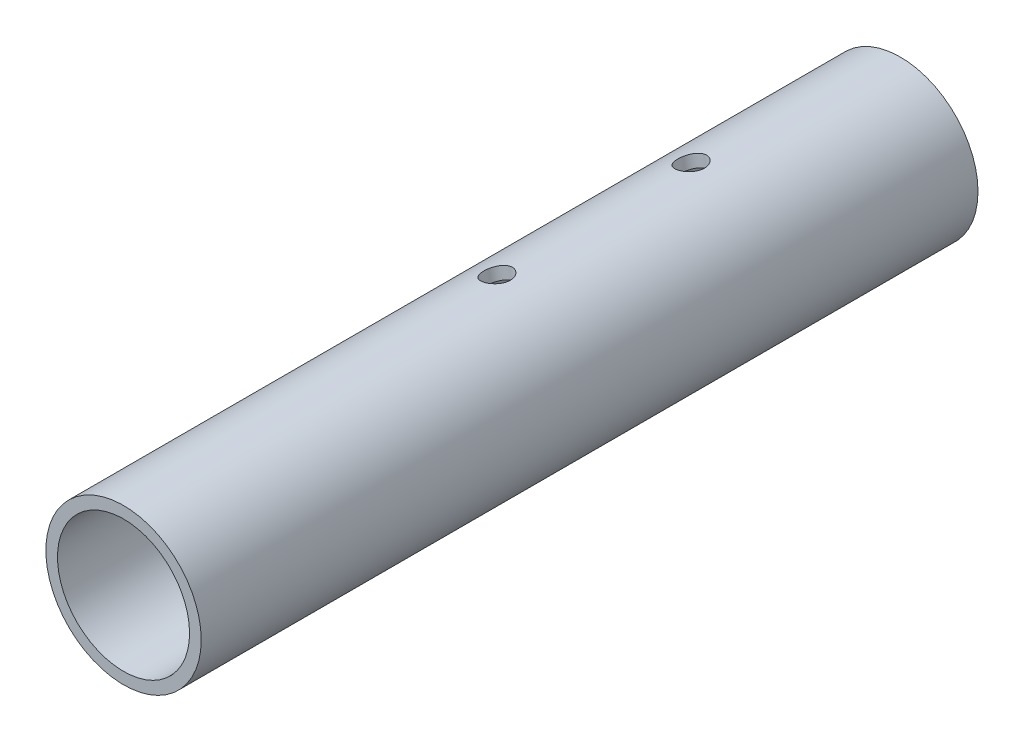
ISO-10303-21;
HEADER;
FILE_DESCRIPTION(('STEP AP214'),'2;1');
FILE_NAME('part.step','',(''),(''),'','','');
FILE_SCHEMA(('AUTOMOTIVE_DESIGN { 1 0 10303 214 1 1 1 1 }'));
ENDSEC;
DATA;
#1=APPLICATION_CONTEXT('core data for automotive mechanical design processes');
#2=APPLICATION_PROTOCOL_DEFINITION('international standard','automotive_design',2000,#1);
#3=PRODUCT_CONTEXT('',#1,'mechanical');
#4=PRODUCT('Part','Part','',(#3));
#5=PRODUCT_RELATED_PRODUCT_CATEGORY('part','',(#4));
#6=PRODUCT_DEFINITION_FORMATION('','',#4);
#7=PRODUCT_DEFINITION_CONTEXT('part definition',#1,'design');
#8=PRODUCT_DEFINITION('design','',#6,#7);
#9=PRODUCT_DEFINITION_SHAPE('','',#8);
#10=(LENGTH_UNIT() NAMED_UNIT(*) SI_UNIT(.MILLI.,.METRE.));
#11=(NAMED_UNIT(*) PLANE_ANGLE_UNIT() SI_UNIT($,.RADIAN.));
#12=(NAMED_UNIT(*) SI_UNIT($,.STERADIAN.) SOLID_ANGLE_UNIT());
#13=UNCERTAINTY_MEASURE_WITH_UNIT(LENGTH_MEASURE(1.E-05),#10,'distance_accuracy_value','');
#14=(GEOMETRIC_REPRESENTATION_CONTEXT(3) GLOBAL_UNCERTAINTY_ASSIGNED_CONTEXT((#13)) GLOBAL_UNIT_ASSIGNED_CONTEXT((#10,
#11,#12)) REPRESENTATION_CONTEXT('',''));
#15=CARTESIAN_POINT('',(0.,0.,0.));
#16=DIRECTION('',(0.,0.,1.));
#17=DIRECTION('',(1.,0.,0.));
#18=AXIS2_PLACEMENT_3D('',#15,#16,#17);
#19=CARTESIAN_POINT('',(-10.4241869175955,-1.53847980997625,200.));
#20=DIRECTION('',(0.,0.,1.));
#21=DIRECTION('',(1.,0.,0.));
#22=AXIS2_PLACEMENT_3D('',#19,#20,#21);
#23=PLANE('',#22);
#24=CARTESIAN_POINT('',(-10.4241869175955,-1.53847980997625,200.));
#25=DIRECTION('',(0.,0.,1.));
#26=DIRECTION('',(1.,0.,0.));
#27=AXIS2_PLACEMENT_3D('',#24,#25,#26);
#28=CIRCLE('',#27,20.);
#29=CARTESIAN_POINT('',(9.5758130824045,-1.53847980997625,200.));
#30=VERTEX_POINT('',#29);
#31=EDGE_CURVE('E10',#30,#30,#28,.T.);
#32=ORIENTED_EDGE('',*,*,#31,.T.);
#33=EDGE_LOOP('',(#32));
#34=FACE_BOUND('',#33,.T.);
#35=CARTESIAN_POINT('',(-10.4241869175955,-1.53847980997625,200.));
#36=DIRECTION('',(0.,0.,1.));
#37=DIRECTION('',(1.,0.,0.));
#38=AXIS2_PLACEMENT_3D('',#35,#36,#37);
#39=CIRCLE('',#38,17.);
#40=CARTESIAN_POINT('',(6.5758130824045,-1.53847980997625,200.));
#41=VERTEX_POINT('',#40);
#42=EDGE_CURVE('E46',#41,#41,#39,.T.);
#43=ORIENTED_EDGE('',*,*,#42,.F.);
#44=EDGE_LOOP('',(#43));
#45=FACE_BOUND('',#44,.T.);
#46=ADVANCED_FACE('F28',(#34,#45),#23,.T.);
#47=CARTESIAN_POINT('',(-10.4241869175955,-1.53847980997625,0.));
#48=DIRECTION('',(0.,0.,1.));
#49=DIRECTION('',(1.,0.,0.));
#50=AXIS2_PLACEMENT_3D('',#47,#48,#49);
#51=PLANE('',#50);
#52=CARTESIAN_POINT('',(-10.4241869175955,-1.53847980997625,0.));
#53=DIRECTION('',(0.,0.,1.));
#54=DIRECTION('',(1.,0.,0.));
#55=AXIS2_PLACEMENT_3D('',#52,#53,#54);
#56=CIRCLE('',#55,20.);
#57=CARTESIAN_POINT('',(9.5758130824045,-1.53847980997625,0.));
#58=VERTEX_POINT('',#57);
#59=EDGE_CURVE('E41',#58,#58,#56,.T.);
#60=ORIENTED_EDGE('',*,*,#59,.F.);
#61=EDGE_LOOP('',(#60));
#62=FACE_BOUND('',#61,.T.);
#63=CARTESIAN_POINT('',(-10.4241869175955,-1.53847980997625,0.));
#64=DIRECTION('',(0.,0.,1.));
#65=DIRECTION('',(1.,0.,0.));
#66=AXIS2_PLACEMENT_3D('',#63,#64,#65);
#67=CIRCLE('',#66,17.);
#68=CARTESIAN_POINT('',(6.5758130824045,-1.53847980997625,0.));
#69=VERTEX_POINT('',#68);
#70=EDGE_CURVE('E49',#69,#69,#67,.T.);
#71=ORIENTED_EDGE('',*,*,#70,.T.);
#72=EDGE_LOOP('',(#71));
#73=FACE_BOUND('',#72,.T.);
#74=ADVANCED_FACE('F96',(#62,#73),#51,.F.);
#75=CARTESIAN_POINT('',(-10.4241869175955,-1.53847980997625,200.));
#76=DIRECTION('',(0.,0.,-1.));
#77=DIRECTION('',(-1.,0.,0.));
#78=AXIS2_PLACEMENT_3D('',#75,#76,#77);
#79=CYLINDRICAL_SURFACE('',#78,20.);
#80=CARTESIAN_POINT('',(-10.8369903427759,18.4572595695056,50.));
#81=CARTESIAN_POINT('',(-10.8369986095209,18.4572616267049,50.1949746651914));
#82=CARTESIAN_POINT('',(-10.853594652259,18.4569380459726,50.3900521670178));
#83=CARTESIAN_POINT('',(-10.9194575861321,18.4554130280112,50.7747231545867));
#84=CARTESIAN_POINT('',(-10.9687536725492,18.4542108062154,50.9643115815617));
#85=CARTESIAN_POINT('',(-11.0983300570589,18.4502595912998,51.3323821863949));
#86=CARTESIAN_POINT('',(-11.1785833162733,18.4475119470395,51.5108738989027));
#87=CARTESIAN_POINT('',(-11.3675143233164,18.4394838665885,51.8520123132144));
#88=CARTESIAN_POINT('',(-11.476189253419,18.4342036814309,52.0146605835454));
#89=CARTESIAN_POINT('',(-11.7198743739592,18.4198816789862,52.3212773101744));
#90=CARTESIAN_POINT('',(-11.855130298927,18.4108037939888,52.4650488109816));
#91=CARTESIAN_POINT('',(-12.1473021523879,18.3876916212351,52.7281180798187));
#92=CARTESIAN_POINT('',(-12.304219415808,18.3736570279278,52.8474143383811));
#93=CARTESIAN_POINT('',(-12.6362664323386,18.3395155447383,53.0588920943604));
#94=CARTESIAN_POINT('',(-12.8115096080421,18.3193691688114,53.1508893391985));
#95=CARTESIAN_POINT('',(-13.1741811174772,18.2723991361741,53.3039722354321));
#96=CARTESIAN_POINT('',(-13.3616085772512,18.2455759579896,53.365060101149));
#97=CARTESIAN_POINT('',(-13.7411432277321,18.1854732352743,53.4539851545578));
#98=CARTESIAN_POINT('',(-13.9331835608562,18.1522620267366,53.4821537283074));
#99=CARTESIAN_POINT('',(-14.3181140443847,18.0797686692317,53.5054718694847));
#100=CARTESIAN_POINT('',(-14.5110041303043,18.0404869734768,53.5006239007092));
#101=CARTESIAN_POINT('',(-14.8899563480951,17.9575232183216,53.4583033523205));
#102=CARTESIAN_POINT('',(-15.0760700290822,17.9138938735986,53.4211874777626));
#103=CARTESIAN_POINT('',(-15.4385398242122,17.8236268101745,53.3159473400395));
#104=CARTESIAN_POINT('',(-15.6148956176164,17.7769889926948,53.2478220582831));
#105=CARTESIAN_POINT('',(-15.9540389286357,17.6826519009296,53.0821481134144));
#106=CARTESIAN_POINT('',(-16.1167542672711,17.6349484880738,52.984454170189));
#107=CARTESIAN_POINT('',(-16.4234918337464,17.5411979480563,52.7625227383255));
#108=CARTESIAN_POINT('',(-16.5675123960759,17.4951509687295,52.6382828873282));
#109=CARTESIAN_POINT('',(-16.8350639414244,17.4067256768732,52.3648127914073));
#110=CARTESIAN_POINT('',(-16.9582952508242,17.3644046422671,52.215270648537));
#111=CARTESIAN_POINT('',(-17.1787507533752,17.2867577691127,51.896487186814));
#112=CARTESIAN_POINT('',(-17.2759746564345,17.2514320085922,51.7272456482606));
#113=CARTESIAN_POINT('',(-17.4419835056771,17.190065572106,51.3734942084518));
#114=CARTESIAN_POINT('',(-17.5107304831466,17.1640372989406,51.1889643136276));
#115=CARTESIAN_POINT('',(-17.6177050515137,17.1231548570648,50.8100840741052));
#116=CARTESIAN_POINT('',(-17.6559356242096,17.1082995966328,50.615734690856));
#117=CARTESIAN_POINT('',(-17.700501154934,17.0909545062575,50.2254703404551));
#118=CARTESIAN_POINT('',(-17.707249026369,17.0883046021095,50.0296095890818));
#119=CARTESIAN_POINT('',(-17.6897817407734,17.0951246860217,49.6394936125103));
#120=CARTESIAN_POINT('',(-17.665567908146,17.1045941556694,49.4452383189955));
#121=CARTESIAN_POINT('',(-17.5871414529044,17.1348651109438,49.0652517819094));
#122=CARTESIAN_POINT('',(-17.5331418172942,17.1555861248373,48.8794700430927));
#123=CARTESIAN_POINT('',(-17.3967415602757,17.2068865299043,48.5200960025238));
#124=CARTESIAN_POINT('',(-17.3143390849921,17.2374665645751,48.346504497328));
#125=CARTESIAN_POINT('',(-17.122277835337,17.3068397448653,48.0145046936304));
#126=CARTESIAN_POINT('',(-17.0123515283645,17.3457129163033,47.856267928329));
#127=CARTESIAN_POINT('',(-16.7684457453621,17.4290437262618,47.561248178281));
#128=CARTESIAN_POINT('',(-16.6344643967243,17.473501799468,47.4244668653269));
#129=CARTESIAN_POINT('',(-16.3441107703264,17.5659158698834,47.1746336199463));
#130=CARTESIAN_POINT('',(-16.1874980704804,17.6139062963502,47.0618735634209));
#131=CARTESIAN_POINT('',(-15.8571251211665,17.7102278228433,46.86533406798));
#132=CARTESIAN_POINT('',(-15.6833654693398,17.7585589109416,46.7815536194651));
#133=CARTESIAN_POINT('',(-15.3242255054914,17.8528557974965,46.6457991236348));
#134=CARTESIAN_POINT('',(-15.1389042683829,17.898831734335,46.5936759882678));
#135=CARTESIAN_POINT('',(-14.7610914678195,17.9866025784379,46.5222371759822));
#136=CARTESIAN_POINT('',(-14.5686005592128,18.0283978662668,46.5029185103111));
#137=CARTESIAN_POINT('',(-14.1846109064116,18.1057831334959,46.4977300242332));
#138=CARTESIAN_POINT('',(-13.9931331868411,18.141448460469,46.5114173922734));
#139=CARTESIAN_POINT('',(-13.6141319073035,18.2064240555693,46.5708900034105));
#140=CARTESIAN_POINT('',(-13.4266083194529,18.235734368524,46.616675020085));
#141=CARTESIAN_POINT('',(-13.0611577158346,18.2877764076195,46.7388667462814));
#142=CARTESIAN_POINT('',(-12.8832181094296,18.3105169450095,46.8152321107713));
#143=CARTESIAN_POINT('',(-12.541700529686,18.3498514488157,46.99636612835));
#144=CARTESIAN_POINT('',(-12.3781233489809,18.3664450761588,47.1011363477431));
#145=CARTESIAN_POINT('',(-12.0679983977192,18.3944694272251,47.3376583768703));
#146=CARTESIAN_POINT('',(-11.9216905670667,18.405832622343,47.4697328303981));
#147=CARTESIAN_POINT('',(-11.6527567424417,18.4242061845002,47.7564396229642));
#148=CARTESIAN_POINT('',(-11.5301363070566,18.4312155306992,47.9110772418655));
#149=CARTESIAN_POINT('',(-11.3114386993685,18.4421333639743,48.239975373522));
#150=CARTESIAN_POINT('',(-11.2155787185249,18.4460169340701,48.4143811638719));
#151=CARTESIAN_POINT('',(-11.0548469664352,18.4517375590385,48.7768337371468));
#152=CARTESIAN_POINT('',(-10.9899448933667,18.4535766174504,48.9648669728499));
#153=CARTESIAN_POINT('',(-10.9069099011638,18.4557227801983,49.2946389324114));
#154=CARTESIAN_POINT('',(-10.8807368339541,18.456316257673,49.434405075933));
#155=CARTESIAN_POINT('',(-10.8457742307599,18.457083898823,49.716096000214));
#156=CARTESIAN_POINT('',(-10.8369843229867,18.4572580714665,49.8580207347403));
#157=CARTESIAN_POINT('',(-10.8369903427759,18.4572595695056,50.));
#158=B_SPLINE_CURVE_WITH_KNOTS('',3,(#80,#81,#82,#83,#84,#85,#86,#87,#88,#89,#90,#91,#92,#93,
#94,#95,#96,#97,#98,#99,#100,#101,#102,#103,#104,#105,#106,#107,#108,#109,#110,#111,#112,#113,
#114,#115,#116,#117,#118,#119,#120,#121,#122,#123,#124,#125,#126,#127,#128,#129,#130,#131,#132,
#133,#134,#135,#136,#137,#138,#139,#140,#141,#142,#143,#144,#145,#146,#147,#148,#149,#150,#151,
#152,#153,#154,#155,#156,#157),.UNSPECIFIED.,.T.,.F.,(4,2,2,2,2,2,2,2,2,2,2,2,2,2,2,2,2,2,2,2,2,
2,2,2,2,2,2,2,2,2,2,2,2,2,2,2,2,2,4),(0.,0.584404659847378,1.16933179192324,1.75374918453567,
2.33810865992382,2.92814866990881,3.51822505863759,4.11219797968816,4.70612834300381,
5.29402687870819,5.88188154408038,6.46331923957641,7.04477603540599,7.6291374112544,
8.21355081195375,8.80577741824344,9.39801063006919,9.99103095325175,10.5839933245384,
11.1691563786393,11.7542944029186,12.3353015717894,12.9163466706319,13.5032750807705,
14.0902492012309,14.683993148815,15.2777164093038,15.8686214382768,16.4594726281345,
17.0424411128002,17.6254054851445,18.2075843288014,18.7897952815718,19.3793255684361,
19.9689940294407,20.5633177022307,21.1570584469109,21.5826271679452,22.0081867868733),.UNSPECIFIED.);
#159=CARTESIAN_POINT('',(-10.8369903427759,18.4572595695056,50.));
#160=VERTEX_POINT('',#159);
#161=EDGE_CURVE('E59',#160,#160,#158,.T.);
#162=ORIENTED_EDGE('',*,*,#161,.T.);
#163=EDGE_LOOP('',(#162));
#164=FACE_BOUND('',#163,.T.);
#165=CARTESIAN_POINT('',(-3.14615687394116,-20.1672285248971,50.));
#166=CARTESIAN_POINT('',(-3.14616372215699,-20.1672335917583,49.8050253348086));
#167=CARTESIAN_POINT('',(-3.16161789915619,-20.1732917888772,49.6099478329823));
#168=CARTESIAN_POINT('',(-3.22304149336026,-20.1971118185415,49.2252768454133));
#169=CARTESIAN_POINT('',(-3.26903817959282,-20.2148841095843,49.0356884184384));
#170=CARTESIAN_POINT('',(-3.3902450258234,-20.2608683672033,48.6676178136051));
#171=CARTESIAN_POINT('',(-3.46542969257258,-20.2890712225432,48.4891261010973));
#172=CARTESIAN_POINT('',(-3.643025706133,-20.3540252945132,48.1479876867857));
#173=CARTESIAN_POINT('',(-3.74543435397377,-20.3907756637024,47.9853394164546));
#174=CARTESIAN_POINT('',(-3.97601915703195,-20.4708893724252,47.6787226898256));
#175=CARTESIAN_POINT('',(-4.10443611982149,-20.5143135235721,47.5349511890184));
#176=CARTESIAN_POINT('',(-4.38317654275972,-20.6048803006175,47.2718819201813));
#177=CARTESIAN_POINT('',(-4.53350135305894,-20.6520231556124,47.1525856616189));
#178=CARTESIAN_POINT('',(-4.85330034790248,-20.7476759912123,46.9411079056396));
#179=CARTESIAN_POINT('',(-5.02289442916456,-20.7961929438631,46.8491106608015));
#180=CARTESIAN_POINT('',(-5.37589608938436,-20.8917263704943,46.6960277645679));
#181=CARTESIAN_POINT('',(-5.55930267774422,-20.938742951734,46.634939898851));
#182=CARTESIAN_POINT('',(-5.93291175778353,-21.028604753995,46.5460148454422));
#183=CARTESIAN_POINT('',(-6.12302631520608,-21.0714874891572,46.5178462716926));
#184=CARTESIAN_POINT('',(-6.50636589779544,-21.1519705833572,46.4945281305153));
#185=CARTESIAN_POINT('',(-6.69959068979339,-21.1895713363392,46.4993760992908));
#186=CARTESIAN_POINT('',(-7.08141865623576,-21.2580926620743,46.5416966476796));
#187=CARTESIAN_POINT('',(-7.27004925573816,-21.2890816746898,46.5788125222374));
#188=CARTESIAN_POINT('',(-7.63944947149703,-21.3445431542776,46.6840526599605));
#189=CARTESIAN_POINT('',(-7.82021882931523,-21.3690154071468,46.7521779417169));
#190=CARTESIAN_POINT('',(-8.16963073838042,-21.4117821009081,46.9178518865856));
#191=CARTESIAN_POINT('',(-8.33820820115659,-21.4300450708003,47.015545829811));
#192=CARTESIAN_POINT('',(-8.65746133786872,-21.4609405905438,47.2374772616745));
#193=CARTESIAN_POINT('',(-8.80813541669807,-21.4735726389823,47.3617171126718));
#194=CARTESIAN_POINT('',(-9.08915149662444,-21.4943770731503,47.6351872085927));
#195=CARTESIAN_POINT('',(-9.21919474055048,-21.5024875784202,47.784729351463));
#196=CARTESIAN_POINT('',(-9.4525782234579,-21.5152082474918,48.103512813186));
#197=CARTESIAN_POINT('',(-9.55591816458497,-21.5198183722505,48.2727543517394));
#198=CARTESIAN_POINT('',(-9.73277154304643,-21.5267220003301,48.6265057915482));
#199=CARTESIAN_POINT('',(-9.80624515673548,-21.5290124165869,48.8110356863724));
#200=CARTESIAN_POINT('',(-9.92072054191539,-21.5322246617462,49.1899159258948));
#201=CARTESIAN_POINT('',(-9.96172548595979,-21.5331466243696,49.384265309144));
#202=CARTESIAN_POINT('',(-10.0095359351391,-21.5341952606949,49.7745296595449));
#203=CARTESIAN_POINT('',(-10.0167841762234,-21.5343322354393,49.9703904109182));
#204=CARTESIAN_POINT('',(-9.99803672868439,-21.533941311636,50.3605063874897));
#205=CARTESIAN_POINT('',(-9.97204246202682,-21.5334134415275,50.5547616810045));
#206=CARTESIAN_POINT('',(-9.88800248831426,-21.5313343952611,50.9347482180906));
#207=CARTESIAN_POINT('',(-9.83018434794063,-21.5297904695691,51.1205299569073));
#208=CARTESIAN_POINT('',(-9.6845370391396,-21.5249301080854,51.4799039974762));
#209=CARTESIAN_POINT('',(-9.59670591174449,-21.5216135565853,51.653495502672));
#210=CARTESIAN_POINT('',(-9.39272022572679,-21.5121266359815,51.9854953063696));
#211=CARTESIAN_POINT('',(-9.27628788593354,-21.5059277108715,52.143732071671));
#212=CARTESIAN_POINT('',(-9.01906549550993,-21.4894748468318,52.438751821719));
#213=CARTESIAN_POINT('',(-8.87827354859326,-21.4792205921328,52.5755331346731));
#214=CARTESIAN_POINT('',(-8.57466664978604,-21.453366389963,52.8253663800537));
#215=CARTESIAN_POINT('',(-8.41161642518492,-21.4377061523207,52.9381264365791));
#216=CARTESIAN_POINT('',(-8.06954580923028,-21.4001320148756,53.13466593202));
#217=CARTESIAN_POINT('',(-7.89052597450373,-21.3782183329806,53.2184463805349));
#218=CARTESIAN_POINT('',(-7.52265799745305,-21.3277548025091,53.3542008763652));
#219=CARTESIAN_POINT('',(-7.33386054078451,-21.299236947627,53.4063240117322));
#220=CARTESIAN_POINT('',(-6.95124373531,-21.2355925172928,53.4777628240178));
#221=CARTESIAN_POINT('',(-6.75742484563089,-21.2004665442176,53.497081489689));
#222=CARTESIAN_POINT('',(-6.37308049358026,-21.1248626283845,53.5022699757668));
#223=CARTESIAN_POINT('',(-6.18254559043,-21.0844623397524,53.4885826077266));
#224=CARTESIAN_POINT('',(-5.80756265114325,-20.9993060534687,53.4291099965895));
#225=CARTESIAN_POINT('',(-5.62311457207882,-20.9545500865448,53.383324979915));
#226=CARTESIAN_POINT('',(-5.26560295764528,-20.8626372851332,53.2611332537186));
#227=CARTESIAN_POINT('',(-5.09252441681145,-20.8154837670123,53.1847678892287));
#228=CARTESIAN_POINT('',(-4.76198801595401,-20.7210001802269,53.00363387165));
#229=CARTESIAN_POINT('',(-4.60453101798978,-20.6736701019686,52.8988636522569));
#230=CARTESIAN_POINT('',(-4.30732521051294,-20.5807639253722,52.6623416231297));
#231=CARTESIAN_POINT('',(-4.16782390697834,-20.5352173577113,52.5302671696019));
#232=CARTESIAN_POINT('',(-3.91236422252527,-20.4491746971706,52.2435603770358));
#233=CARTESIAN_POINT('',(-3.79641136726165,-20.4086797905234,52.0889227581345));
#234=CARTESIAN_POINT('',(-3.59021219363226,-20.3349929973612,51.760024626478));
#235=CARTESIAN_POINT('',(-3.50017604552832,-20.3018612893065,51.5856188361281));
#236=CARTESIAN_POINT('',(-3.34951234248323,-20.2455774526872,51.2231662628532));
#237=CARTESIAN_POINT('',(-3.28885602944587,-20.222415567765,51.0351330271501));
#238=CARTESIAN_POINT('',(-3.21133219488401,-20.1925915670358,50.7053610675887));
#239=CARTESIAN_POINT('',(-3.18692806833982,-20.1831142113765,50.565594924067));
#240=CARTESIAN_POINT('',(-3.15433808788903,-20.1704309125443,50.283903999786));
#241=CARTESIAN_POINT('',(-3.14615188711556,-20.1672248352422,50.1419792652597));
#242=CARTESIAN_POINT('',(-3.14615687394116,-20.1672285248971,50.));
#243=B_SPLINE_CURVE_WITH_KNOTS('',3,(#165,#166,#167,#168,#169,#170,#171,#172,#173,#174,#175,
#176,#177,#178,#179,#180,#181,#182,#183,#184,#185,#186,#187,#188,#189,#190,#191,#192,#193,#194,
#195,#196,#197,#198,#199,#200,#201,#202,#203,#204,#205,#206,#207,#208,#209,#210,#211,#212,#213,
#214,#215,#216,#217,#218,#219,#220,#221,#222,#223,#224,#225,#226,#227,#228,#229,#230,#231,#232,
#233,#234,#235,#236,#237,#238,#239,#240,#241,#242),.UNSPECIFIED.,.T.,.F.,(4,2,2,2,2,2,2,2,2,2,2,
2,2,2,2,2,2,2,2,2,2,2,2,2,2,2,2,2,2,2,2,2,2,2,2,2,2,2,4),(0.,0.584404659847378,1.16933179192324,
1.75374918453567,2.33810865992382,2.92814866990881,3.51822505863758,4.11219797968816,
4.7061283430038,5.29402687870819,5.88188154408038,6.46331923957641,7.04477603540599,
7.62913741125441,8.21355081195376,8.80577741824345,9.3980106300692,9.99103095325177,
10.5839933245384,11.1691563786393,11.7542944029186,12.3353015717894,12.9163466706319,
13.5032750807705,14.0902492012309,14.683993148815,15.2777164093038,15.8686214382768,
16.4594726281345,17.0424411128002,17.6254054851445,18.2075843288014,18.7897952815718,
19.3793255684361,19.9689940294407,20.5633177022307,21.1570584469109,21.5826271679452,
22.0081867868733),.UNSPECIFIED.);
#244=CARTESIAN_POINT('',(-3.14615687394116,-20.1672285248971,50.));
#245=VERTEX_POINT('',#244);
#246=EDGE_CURVE('E162',#245,#245,#243,.T.);
#247=ORIENTED_EDGE('',*,*,#246,.T.);
#248=EDGE_LOOP('',(#247));
#249=FACE_BOUND('',#248,.T.);
#250=CARTESIAN_POINT('',(-10.8369903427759,18.4572595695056,100.));
#251=CARTESIAN_POINT('',(-10.8369986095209,18.4572616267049,100.194974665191));
#252=CARTESIAN_POINT('',(-10.853594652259,18.4569380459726,100.390052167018));
#253=CARTESIAN_POINT('',(-10.9194575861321,18.4554130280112,100.774723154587));
#254=CARTESIAN_POINT('',(-10.9687536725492,18.4542108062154,100.964311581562));
#255=CARTESIAN_POINT('',(-11.0983300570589,18.4502595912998,101.332382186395));
#256=CARTESIAN_POINT('',(-11.1785833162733,18.4475119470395,101.510873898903));
#257=CARTESIAN_POINT('',(-11.3675143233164,18.4394838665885,101.852012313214));
#258=CARTESIAN_POINT('',(-11.476189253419,18.4342036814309,102.014660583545));
#259=CARTESIAN_POINT('',(-11.7198743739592,18.4198816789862,102.321277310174));
#260=CARTESIAN_POINT('',(-11.855130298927,18.4108037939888,102.465048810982));
#261=CARTESIAN_POINT('',(-12.1473021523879,18.3876916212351,102.728118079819));
#262=CARTESIAN_POINT('',(-12.304219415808,18.3736570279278,102.847414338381));
#263=CARTESIAN_POINT('',(-12.6362664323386,18.3395155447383,103.05889209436));
#264=CARTESIAN_POINT('',(-12.8115096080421,18.3193691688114,103.150889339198));
#265=CARTESIAN_POINT('',(-13.1741811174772,18.2723991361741,103.303972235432));
#266=CARTESIAN_POINT('',(-13.3616085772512,18.2455759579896,103.365060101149));
#267=CARTESIAN_POINT('',(-13.7411432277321,18.1854732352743,103.453985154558));
#268=CARTESIAN_POINT('',(-13.9331835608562,18.1522620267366,103.482153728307));
#269=CARTESIAN_POINT('',(-14.3181140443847,18.0797686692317,103.505471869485));
#270=CARTESIAN_POINT('',(-14.5110041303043,18.0404869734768,103.500623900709));
#271=CARTESIAN_POINT('',(-14.8899563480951,17.9575232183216,103.45830335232));
#272=CARTESIAN_POINT('',(-15.0760700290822,17.9138938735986,103.421187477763));
#273=CARTESIAN_POINT('',(-15.4385398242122,17.8236268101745,103.31594734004));
#274=CARTESIAN_POINT('',(-15.6148956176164,17.7769889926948,103.247822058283));
#275=CARTESIAN_POINT('',(-15.9540389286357,17.6826519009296,103.082148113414));
#276=CARTESIAN_POINT('',(-16.1167542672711,17.6349484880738,102.984454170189));
#277=CARTESIAN_POINT('',(-16.4234918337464,17.5411979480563,102.762522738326));
#278=CARTESIAN_POINT('',(-16.5675123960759,17.4951509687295,102.638282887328));
#279=CARTESIAN_POINT('',(-16.8350639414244,17.4067256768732,102.364812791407));
#280=CARTESIAN_POINT('',(-16.9582952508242,17.3644046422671,102.215270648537));
#281=CARTESIAN_POINT('',(-17.1787507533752,17.2867577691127,101.896487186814));
#282=CARTESIAN_POINT('',(-17.2759746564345,17.2514320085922,101.727245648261));
#283=CARTESIAN_POINT('',(-17.4419835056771,17.190065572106,101.373494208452));
#284=CARTESIAN_POINT('',(-17.5107304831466,17.1640372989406,101.188964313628));
#285=CARTESIAN_POINT('',(-17.6177050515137,17.1231548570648,100.810084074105));
#286=CARTESIAN_POINT('',(-17.6559356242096,17.1082995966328,100.615734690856));
#287=CARTESIAN_POINT('',(-17.700501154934,17.0909545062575,100.225470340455));
#288=CARTESIAN_POINT('',(-17.707249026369,17.0883046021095,100.029609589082));
#289=CARTESIAN_POINT('',(-17.6897817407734,17.0951246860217,99.6394936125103));
#290=CARTESIAN_POINT('',(-17.665567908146,17.1045941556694,99.4452383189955));
#291=CARTESIAN_POINT('',(-17.5871414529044,17.1348651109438,99.0652517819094));
#292=CARTESIAN_POINT('',(-17.5331418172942,17.1555861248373,98.8794700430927));
#293=CARTESIAN_POINT('',(-17.3967415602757,17.2068865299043,98.5200960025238));
#294=CARTESIAN_POINT('',(-17.3143390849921,17.2374665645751,98.346504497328));
#295=CARTESIAN_POINT('',(-17.122277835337,17.3068397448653,98.0145046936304));
#296=CARTESIAN_POINT('',(-17.0123515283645,17.3457129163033,97.856267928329));
#297=CARTESIAN_POINT('',(-16.7684457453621,17.4290437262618,97.561248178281));
#298=CARTESIAN_POINT('',(-16.6344643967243,17.473501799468,97.4244668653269));
#299=CARTESIAN_POINT('',(-16.3441107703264,17.5659158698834,97.1746336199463));
#300=CARTESIAN_POINT('',(-16.1874980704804,17.6139062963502,97.0618735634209));
#301=CARTESIAN_POINT('',(-15.8571251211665,17.7102278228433,96.86533406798));
#302=CARTESIAN_POINT('',(-15.6833654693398,17.7585589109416,96.7815536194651));
#303=CARTESIAN_POINT('',(-15.3242255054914,17.8528557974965,96.6457991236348));
#304=CARTESIAN_POINT('',(-15.1389042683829,17.898831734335,96.5936759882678));
#305=CARTESIAN_POINT('',(-14.7610914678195,17.9866025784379,96.5222371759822));
#306=CARTESIAN_POINT('',(-14.5686005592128,18.0283978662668,96.502918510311));
#307=CARTESIAN_POINT('',(-14.1846109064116,18.1057831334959,96.4977300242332));
#308=CARTESIAN_POINT('',(-13.9931331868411,18.141448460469,96.5114173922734));
#309=CARTESIAN_POINT('',(-13.6141319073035,18.2064240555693,96.5708900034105));
#310=CARTESIAN_POINT('',(-13.4266083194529,18.235734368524,96.616675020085));
#311=CARTESIAN_POINT('',(-13.0611577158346,18.2877764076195,96.7388667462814));
#312=CARTESIAN_POINT('',(-12.8832181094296,18.3105169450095,96.8152321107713));
#313=CARTESIAN_POINT('',(-12.541700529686,18.3498514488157,96.99636612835));
#314=CARTESIAN_POINT('',(-12.3781233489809,18.3664450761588,97.1011363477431));
#315=CARTESIAN_POINT('',(-12.0679983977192,18.3944694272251,97.3376583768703));
#316=CARTESIAN_POINT('',(-11.9216905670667,18.405832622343,97.4697328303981));
#317=CARTESIAN_POINT('',(-11.6527567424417,18.4242061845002,97.7564396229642));
#318=CARTESIAN_POINT('',(-11.5301363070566,18.4312155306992,97.9110772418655));
#319=CARTESIAN_POINT('',(-11.3114386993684,18.4421333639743,98.239975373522));
#320=CARTESIAN_POINT('',(-11.2155787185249,18.4460169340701,98.4143811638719));
#321=CARTESIAN_POINT('',(-11.0548469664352,18.4517375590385,98.7768337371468));
#322=CARTESIAN_POINT('',(-10.9899448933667,18.4535766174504,98.9648669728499));
#323=CARTESIAN_POINT('',(-10.9069099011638,18.4557227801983,99.2946389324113));
#324=CARTESIAN_POINT('',(-10.8807368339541,18.456316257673,99.434405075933));
#325=CARTESIAN_POINT('',(-10.8457742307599,18.457083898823,99.716096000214));
#326=CARTESIAN_POINT('',(-10.8369843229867,18.4572580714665,99.8580207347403));
#327=CARTESIAN_POINT('',(-10.8369903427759,18.4572595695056,100.));
#328=B_SPLINE_CURVE_WITH_KNOTS('',3,(#250,#251,#252,#253,#254,#255,#256,#257,#258,#259,#260,
#261,#262,#263,#264,#265,#266,#267,#268,#269,#270,#271,#272,#273,#274,#275,#276,#277,#278,#279,
#280,#281,#282,#283,#284,#285,#286,#287,#288,#289,#290,#291,#292,#293,#294,#295,#296,#297,#298,
#299,#300,#301,#302,#303,#304,#305,#306,#307,#308,#309,#310,#311,#312,#313,#314,#315,#316,#317,
#318,#319,#320,#321,#322,#323,#324,#325,#326,#327),.UNSPECIFIED.,.T.,.F.,(4,2,2,2,2,2,2,2,2,2,2,
2,2,2,2,2,2,2,2,2,2,2,2,2,2,2,2,2,2,2,2,2,2,2,2,2,2,2,4),(0.,0.584404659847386,1.16933179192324,
1.75374918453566,2.3381086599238,2.9281486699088,3.51822505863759,4.11219797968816,
4.7061283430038,5.29402687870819,5.88188154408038,6.46331923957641,7.04477603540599,
7.62913741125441,8.21355081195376,8.80577741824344,9.39801063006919,9.99103095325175,
10.5839933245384,11.1691563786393,11.7542944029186,12.3353015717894,12.9163466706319,
13.5032750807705,14.0902492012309,14.683993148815,15.2777164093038,15.8686214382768,
16.4594726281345,17.0424411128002,17.6254054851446,18.2075843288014,18.7897952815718,
19.3793255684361,19.9689940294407,20.5633177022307,21.1570584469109,21.5826271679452,
22.0081867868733),.UNSPECIFIED.);
#329=CARTESIAN_POINT('',(-10.8369903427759,18.4572595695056,100.));
#330=VERTEX_POINT('',#329);
#331=EDGE_CURVE('E83',#330,#330,#328,.T.);
#332=ORIENTED_EDGE('',*,*,#331,.T.);
#333=EDGE_LOOP('',(#332));
#334=FACE_BOUND('',#333,.T.);
#335=CARTESIAN_POINT('',(-3.14615687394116,-20.1672285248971,100.));
#336=CARTESIAN_POINT('',(-3.14616372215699,-20.1672335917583,99.8050253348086));
#337=CARTESIAN_POINT('',(-3.16161789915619,-20.1732917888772,99.6099478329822));
#338=CARTESIAN_POINT('',(-3.22304149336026,-20.1971118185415,99.2252768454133));
#339=CARTESIAN_POINT('',(-3.26903817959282,-20.2148841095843,99.0356884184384));
#340=CARTESIAN_POINT('',(-3.3902450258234,-20.2608683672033,98.6676178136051));
#341=CARTESIAN_POINT('',(-3.46542969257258,-20.2890712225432,98.4891261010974));
#342=CARTESIAN_POINT('',(-3.64302570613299,-20.3540252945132,98.1479876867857));
#343=CARTESIAN_POINT('',(-3.74543435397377,-20.3907756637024,97.9853394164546));
#344=CARTESIAN_POINT('',(-3.97601915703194,-20.4708893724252,97.6787226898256));
#345=CARTESIAN_POINT('',(-4.10443611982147,-20.5143135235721,97.5349511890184));
#346=CARTESIAN_POINT('',(-4.38317654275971,-20.6048803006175,97.2718819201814));
#347=CARTESIAN_POINT('',(-4.53350135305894,-20.6520231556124,97.1525856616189));
#348=CARTESIAN_POINT('',(-4.85330034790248,-20.7476759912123,96.9411079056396));
#349=CARTESIAN_POINT('',(-5.02289442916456,-20.7961929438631,96.8491106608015));
#350=CARTESIAN_POINT('',(-5.37589608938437,-20.8917263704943,96.6960277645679));
#351=CARTESIAN_POINT('',(-5.55930267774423,-20.938742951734,96.634939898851));
#352=CARTESIAN_POINT('',(-5.93291175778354,-21.028604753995,96.5460148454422));
#353=CARTESIAN_POINT('',(-6.12302631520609,-21.0714874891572,96.5178462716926));
#354=CARTESIAN_POINT('',(-6.50636589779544,-21.1519705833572,96.4945281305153));
#355=CARTESIAN_POINT('',(-6.69959068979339,-21.1895713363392,96.4993760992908));
#356=CARTESIAN_POINT('',(-7.08141865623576,-21.2580926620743,96.5416966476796));
#357=CARTESIAN_POINT('',(-7.27004925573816,-21.2890816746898,96.5788125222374));
#358=CARTESIAN_POINT('',(-7.63944947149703,-21.3445431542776,96.6840526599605));
#359=CARTESIAN_POINT('',(-7.82021882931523,-21.3690154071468,96.7521779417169));
#360=CARTESIAN_POINT('',(-8.16963073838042,-21.4117821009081,96.9178518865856));
#361=CARTESIAN_POINT('',(-8.33820820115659,-21.4300450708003,97.015545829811));
#362=CARTESIAN_POINT('',(-8.65746133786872,-21.4609405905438,97.2374772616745));
#363=CARTESIAN_POINT('',(-8.80813541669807,-21.4735726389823,97.3617171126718));
#364=CARTESIAN_POINT('',(-9.08915149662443,-21.4943770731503,97.6351872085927));
#365=CARTESIAN_POINT('',(-9.21919474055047,-21.5024875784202,97.784729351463));
#366=CARTESIAN_POINT('',(-9.45257822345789,-21.5152082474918,98.103512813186));
#367=CARTESIAN_POINT('',(-9.55591816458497,-21.5198183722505,98.2727543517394));
#368=CARTESIAN_POINT('',(-9.73277154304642,-21.5267220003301,98.6265057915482));
#369=CARTESIAN_POINT('',(-9.80624515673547,-21.5290124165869,98.8110356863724));
#370=CARTESIAN_POINT('',(-9.92072054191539,-21.5322246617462,99.1899159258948));
#371=CARTESIAN_POINT('',(-9.96172548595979,-21.5331466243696,99.384265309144));
#372=CARTESIAN_POINT('',(-10.0095359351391,-21.5341952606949,99.7745296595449));
#373=CARTESIAN_POINT('',(-10.0167841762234,-21.5343322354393,99.9703904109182));
#374=CARTESIAN_POINT('',(-9.99803672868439,-21.533941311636,100.36050638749));
#375=CARTESIAN_POINT('',(-9.97204246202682,-21.5334134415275,100.554761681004));
#376=CARTESIAN_POINT('',(-9.88800248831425,-21.5313343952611,100.934748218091));
#377=CARTESIAN_POINT('',(-9.83018434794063,-21.5297904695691,101.120529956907));
#378=CARTESIAN_POINT('',(-9.68453703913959,-21.5249301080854,101.479903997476));
#379=CARTESIAN_POINT('',(-9.59670591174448,-21.5216135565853,101.653495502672));
#380=CARTESIAN_POINT('',(-9.39272022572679,-21.5121266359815,101.98549530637));
#381=CARTESIAN_POINT('',(-9.27628788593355,-21.5059277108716,102.143732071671));
#382=CARTESIAN_POINT('',(-9.01906549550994,-21.4894748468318,102.438751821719));
#383=CARTESIAN_POINT('',(-8.87827354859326,-21.4792205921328,102.575533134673));
#384=CARTESIAN_POINT('',(-8.57466664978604,-21.453366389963,102.825366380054));
#385=CARTESIAN_POINT('',(-8.41161642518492,-21.4377061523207,102.938126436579));
#386=CARTESIAN_POINT('',(-8.06954580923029,-21.4001320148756,103.13466593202));
#387=CARTESIAN_POINT('',(-7.89052597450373,-21.3782183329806,103.218446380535));
#388=CARTESIAN_POINT('',(-7.52265799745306,-21.3277548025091,103.354200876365));
#389=CARTESIAN_POINT('',(-7.33386054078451,-21.299236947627,103.406324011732));
#390=CARTESIAN_POINT('',(-6.95124373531,-21.2355925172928,103.477762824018));
#391=CARTESIAN_POINT('',(-6.75742484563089,-21.2004665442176,103.497081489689));
#392=CARTESIAN_POINT('',(-6.37308049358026,-21.1248626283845,103.502269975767));
#393=CARTESIAN_POINT('',(-6.18254559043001,-21.0844623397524,103.488582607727));
#394=CARTESIAN_POINT('',(-5.80756265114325,-20.9993060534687,103.42910999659));
#395=CARTESIAN_POINT('',(-5.62311457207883,-20.9545500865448,103.383324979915));
#396=CARTESIAN_POINT('',(-5.26560295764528,-20.8626372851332,103.261133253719));
#397=CARTESIAN_POINT('',(-5.09252441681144,-20.8154837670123,103.184767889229));
#398=CARTESIAN_POINT('',(-4.76198801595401,-20.7210001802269,103.00363387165));
#399=CARTESIAN_POINT('',(-4.60453101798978,-20.6736701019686,102.898863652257));
#400=CARTESIAN_POINT('',(-4.30732521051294,-20.5807639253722,102.66234162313));
#401=CARTESIAN_POINT('',(-4.16782390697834,-20.5352173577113,102.530267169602));
#402=CARTESIAN_POINT('',(-3.91236422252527,-20.4491746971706,102.243560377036));
#403=CARTESIAN_POINT('',(-3.79641136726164,-20.4086797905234,102.088922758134));
#404=CARTESIAN_POINT('',(-3.59021219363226,-20.3349929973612,101.760024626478));
#405=CARTESIAN_POINT('',(-3.50017604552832,-20.3018612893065,101.585618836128));
#406=CARTESIAN_POINT('',(-3.34951234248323,-20.2455774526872,101.223166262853));
#407=CARTESIAN_POINT('',(-3.28885602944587,-20.222415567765,101.03513302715));
#408=CARTESIAN_POINT('',(-3.21133219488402,-20.1925915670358,100.705361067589));
#409=CARTESIAN_POINT('',(-3.18692806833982,-20.1831142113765,100.565594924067));
#410=CARTESIAN_POINT('',(-3.15433808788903,-20.1704309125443,100.283903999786));
#411=CARTESIAN_POINT('',(-3.14615188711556,-20.1672248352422,100.14197926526));
#412=CARTESIAN_POINT('',(-3.14615687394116,-20.1672285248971,100.));
#413=B_SPLINE_CURVE_WITH_KNOTS('',3,(#335,#336,#337,#338,#339,#340,#341,#342,#343,#344,#345,
#346,#347,#348,#349,#350,#351,#352,#353,#354,#355,#356,#357,#358,#359,#360,#361,#362,#363,#364,
#365,#366,#367,#368,#369,#370,#371,#372,#373,#374,#375,#376,#377,#378,#379,#380,#381,#382,#383,
#384,#385,#386,#387,#388,#389,#390,#391,#392,#393,#394,#395,#396,#397,#398,#399,#400,#401,#402,
#403,#404,#405,#406,#407,#408,#409,#410,#411,#412),.UNSPECIFIED.,.T.,.F.,(4,2,2,2,2,2,2,2,2,2,2,
2,2,2,2,2,2,2,2,2,2,2,2,2,2,2,2,2,2,2,2,2,2,2,2,2,2,2,4),(0.,0.584404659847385,1.16933179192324,
1.75374918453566,2.3381086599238,2.9281486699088,3.51822505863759,4.11219797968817,
4.70612834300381,5.2940268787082,5.88188154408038,6.46331923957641,7.04477603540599,
7.6291374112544,8.21355081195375,8.80577741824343,9.39801063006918,9.99103095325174,
10.5839933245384,11.1691563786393,11.7542944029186,12.3353015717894,12.9163466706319,
13.5032750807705,14.0902492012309,14.683993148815,15.2777164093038,15.8686214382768,
16.4594726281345,17.0424411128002,17.6254054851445,18.2075843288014,18.7897952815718,
19.3793255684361,19.9689940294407,20.5633177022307,21.1570584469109,21.5826271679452,
22.0081867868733),.UNSPECIFIED.);
#414=CARTESIAN_POINT('',(-3.14615687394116,-20.1672285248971,100.));
#415=VERTEX_POINT('',#414);
#416=EDGE_CURVE('E78',#415,#415,#413,.T.);
#417=ORIENTED_EDGE('',*,*,#416,.T.);
#418=EDGE_LOOP('',(#417));
#419=FACE_BOUND('',#418,.T.);
#420=ORIENTED_EDGE('',*,*,#31,.F.);
#421=EDGE_LOOP('',(#420));
#422=FACE_BOUND('',#421,.T.);
#423=ORIENTED_EDGE('',*,*,#59,.T.);
#424=EDGE_LOOP('',(#423));
#425=FACE_BOUND('',#424,.T.);
#426=ADVANCED_FACE('F30',(#164,#249,#334,#419,#422,#425),#79,.T.);
#427=CARTESIAN_POINT('',(-10.4241869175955,-1.53847980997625,200.));
#428=DIRECTION('',(0.,0.,-1.));
#429=DIRECTION('',(-1.,0.,0.));
#430=AXIS2_PLACEMENT_3D('',#427,#428,#429);
#431=CYLINDRICAL_SURFACE('',#430,17.);
#432=CARTESIAN_POINT('',(-10.2402864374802,15.4605254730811,50.));
#433=CARTESIAN_POINT('',(-10.2402941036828,15.4605279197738,50.1943479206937));
#434=CARTESIAN_POINT('',(-10.2568886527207,15.4607300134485,50.3887832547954));
#435=CARTESIAN_POINT('',(-10.3227112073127,15.4612480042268,50.7721446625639));
#436=CARTESIAN_POINT('',(-10.3719645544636,15.4615639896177,50.9610663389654));
#437=CARTESIAN_POINT('',(-10.5013394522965,15.461467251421,51.327798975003));
#438=CARTESIAN_POINT('',(-10.5814293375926,15.4610552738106,51.5056211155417));
#439=CARTESIAN_POINT('',(-10.7698668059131,15.4582653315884,51.8455477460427));
#440=CARTESIAN_POINT('',(-10.8782131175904,15.4558874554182,52.0076529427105));
#441=CARTESIAN_POINT('',(-11.1215107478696,15.4476531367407,52.3139788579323));
#442=CARTESIAN_POINT('',(-11.2568001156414,15.4417503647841,52.4579298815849));
#443=CARTESIAN_POINT('',(-11.5490470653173,15.4248946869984,52.7215044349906));
#444=CARTESIAN_POINT('',(-11.7060062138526,15.4139414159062,52.8411262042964));
#445=CARTESIAN_POINT('',(-12.038611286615,15.3855181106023,53.0536993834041));
#446=CARTESIAN_POINT('',(-12.2144168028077,15.3679886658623,53.146393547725));
#447=CARTESIAN_POINT('',(-12.5783014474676,15.3254847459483,53.3008189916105));
#448=CARTESIAN_POINT('',(-12.7663793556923,15.300511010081,53.3625533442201));
#449=CARTESIAN_POINT('',(-13.1464934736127,15.2432202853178,53.4524645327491));
#450=CARTESIAN_POINT('',(-13.3384379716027,15.2110105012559,53.4810971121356));
#451=CARTESIAN_POINT('',(-13.7230854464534,15.1395151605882,53.5054148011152));
#452=CARTESIAN_POINT('',(-13.9157883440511,15.1002303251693,53.5011032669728));
#453=CARTESIAN_POINT('',(-14.2934360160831,15.0164523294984,53.4599988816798));
#454=CARTESIAN_POINT('',(-14.4784539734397,14.9720466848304,53.4236970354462));
#455=CARTESIAN_POINT('',(-14.8387024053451,14.8793966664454,53.3204224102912));
#456=CARTESIAN_POINT('',(-15.0139324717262,14.831152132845,53.2534483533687));
#457=CARTESIAN_POINT('',(-15.3511762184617,14.7328404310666,53.0902818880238));
#458=CARTESIAN_POINT('',(-15.5130947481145,14.6827633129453,52.9938990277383));
#459=CARTESIAN_POINT('',(-15.8184233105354,14.5838032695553,52.7747921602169));
#460=CARTESIAN_POINT('',(-15.9618310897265,14.5349204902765,52.6520649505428));
#461=CARTESIAN_POINT('',(-16.2291612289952,14.4403431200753,52.3810657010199));
#462=CARTESIAN_POINT('',(-16.3526750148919,14.3947240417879,52.2323639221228));
#463=CARTESIAN_POINT('',(-16.5738937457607,14.3106574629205,51.9150526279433));
#464=CARTESIAN_POINT('',(-16.6715981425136,14.2722101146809,51.7464426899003));
#465=CARTESIAN_POINT('',(-16.8388835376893,14.2050855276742,51.393481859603));
#466=CARTESIAN_POINT('',(-16.9083971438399,14.1764317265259,51.2090945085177));
#467=CARTESIAN_POINT('',(-17.0170390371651,14.1311660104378,50.8301726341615));
#468=CARTESIAN_POINT('',(-17.0561715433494,14.1145524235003,50.6356395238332));
#469=CARTESIAN_POINT('',(-17.1024998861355,14.0948424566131,50.2457230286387));
#470=CARTESIAN_POINT('',(-17.1102613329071,14.0915066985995,50.0504188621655));
#471=CARTESIAN_POINT('',(-17.0951813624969,14.097948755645,49.6612230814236));
#472=CARTESIAN_POINT('',(-17.072341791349,14.1077257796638,49.467331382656));
#473=CARTESIAN_POINT('',(-16.9971104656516,14.1394759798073,49.0885081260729));
#474=CARTESIAN_POINT('',(-16.9450243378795,14.1613229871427,48.903505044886));
#475=CARTESIAN_POINT('',(-16.8129235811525,14.2155390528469,48.5453982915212));
#476=CARTESIAN_POINT('',(-16.7329065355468,14.2479090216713,48.3722956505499));
#477=CARTESIAN_POINT('',(-16.5456797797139,14.321455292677,48.0402804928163));
#478=CARTESIAN_POINT('',(-16.4381110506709,14.3627466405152,47.8815960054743));
#479=CARTESIAN_POINT('',(-16.1989779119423,14.4511418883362,47.5853159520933));
#480=CARTESIAN_POINT('',(-16.0674108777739,14.4982464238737,47.4477226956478));
#481=CARTESIAN_POINT('',(-15.7811028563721,14.5961620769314,47.1952339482));
#482=CARTESIAN_POINT('',(-15.6260182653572,14.6470211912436,47.0807461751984));
#483=CARTESIAN_POINT('',(-15.2982245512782,14.7487287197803,46.8806174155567));
#484=CARTESIAN_POINT('',(-15.1255161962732,14.7995771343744,46.7949751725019));
#485=CARTESIAN_POINT('',(-14.7681201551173,14.8981978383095,46.6555547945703));
#486=CARTESIAN_POINT('',(-14.583510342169,14.9459867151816,46.6015890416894));
#487=CARTESIAN_POINT('',(-14.2065517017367,15.0365392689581,46.5264614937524));
#488=CARTESIAN_POINT('',(-14.0142038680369,15.079303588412,46.5052954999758));
#489=CARTESIAN_POINT('',(-13.6309652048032,15.157451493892,46.4965389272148));
#490=CARTESIAN_POINT('',(-13.44011286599,15.1929565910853,46.5083366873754));
#491=CARTESIAN_POINT('',(-13.0618757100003,15.2567394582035,46.5638168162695));
#492=CARTESIAN_POINT('',(-12.8744908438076,15.285017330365,46.6074987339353));
#493=CARTESIAN_POINT('',(-12.5090555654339,15.3341980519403,46.7252286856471));
#494=CARTESIAN_POINT('',(-12.3309826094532,15.3551194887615,46.799199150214));
#495=CARTESIAN_POINT('',(-11.9886553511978,15.3902556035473,46.9753270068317));
#496=CARTESIAN_POINT('',(-11.8244022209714,15.4044697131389,47.0774867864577));
#497=CARTESIAN_POINT('',(-11.5116352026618,15.4274417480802,47.309135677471));
#498=CARTESIAN_POINT('',(-11.3634366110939,15.4361027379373,47.4390601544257));
#499=CARTESIAN_POINT('',(-11.0903058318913,15.4490163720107,47.7216607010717));
#500=CARTESIAN_POINT('',(-10.9653791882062,15.4532679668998,47.8743421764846));
#501=CARTESIAN_POINT('',(-10.7412902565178,15.4589373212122,48.2002392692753));
#502=CARTESIAN_POINT('',(-10.6424420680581,15.4603217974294,48.3736716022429));
#503=CARTESIAN_POINT('',(-10.4757382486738,15.4616480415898,48.7347350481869));
#504=CARTESIAN_POINT('',(-10.4078550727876,15.4615910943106,48.9223533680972));
#505=CARTESIAN_POINT('',(-10.3180915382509,15.4612316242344,49.2586066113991));
#506=CARTESIAN_POINT('',(-10.2889731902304,15.4609936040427,49.4053508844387));
#507=CARTESIAN_POINT('',(-10.2500680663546,15.4606395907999,49.7013796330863));
#508=CARTESIAN_POINT('',(-10.2402805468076,15.4605235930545,49.8506640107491));
#509=CARTESIAN_POINT('',(-10.2402864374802,15.4605254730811,50.));
#510=B_SPLINE_CURVE_WITH_KNOTS('',3,(#432,#433,#434,#435,#436,#437,#438,#439,#440,#441,#442,
#443,#444,#445,#446,#447,#448,#449,#450,#451,#452,#453,#454,#455,#456,#457,#458,#459,#460,#461,
#462,#463,#464,#465,#466,#467,#468,#469,#470,#471,#472,#473,#474,#475,#476,#477,#478,#479,#480,
#481,#482,#483,#484,#485,#486,#487,#488,#489,#490,#491,#492,#493,#494,#495,#496,#497,#498,#499,
#500,#501,#502,#503,#504,#505,#506,#507,#508,#509),.UNSPECIFIED.,.T.,.F.,(4,2,2,2,2,2,2,2,2,2,2,
2,2,2,2,2,2,2,2,2,2,2,2,2,2,2,2,2,2,2,2,2,2,2,2,2,2,2,4),(0.,0.582496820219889,1.16544615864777,
1.74779846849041,2.33012458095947,2.92027835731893,3.51047482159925,4.1061369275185,
4.70173989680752,5.2890411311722,5.8762825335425,6.4546646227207,7.03307081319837,
7.61530526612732,8.19761053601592,8.79066525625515,9.3837325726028,9.97820942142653,
10.5726037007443,11.156232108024,11.739825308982,12.3174305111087,12.8950857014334,
13.4806893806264,14.0663571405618,14.6615968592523,15.2568106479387,15.84846248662,
16.4400385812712,17.0207109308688,17.601375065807,18.1805613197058,18.7597966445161,
19.3488860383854,19.9381155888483,20.5341477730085,21.1296487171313,21.5772536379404,
22.024841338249),.UNSPECIFIED.);
#511=CARTESIAN_POINT('',(-10.2402864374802,15.4605254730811,50.));
#512=VERTEX_POINT('',#511);
#513=EDGE_CURVE('E33',#512,#512,#510,.T.);
#514=ORIENTED_EDGE('',*,*,#513,.F.);
#515=EDGE_LOOP('',(#514));
#516=FACE_BOUND('',#515,.T.);
#517=CARTESIAN_POINT('',(-3.7428607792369,-17.1704944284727,50.));
#518=CARTESIAN_POINT('',(-3.74286692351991,-17.1704996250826,49.8056520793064));
#519=CARTESIAN_POINT('',(-3.75811836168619,-17.177042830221,49.6112167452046));
#520=CARTESIAN_POINT('',(-3.81872208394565,-17.2027345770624,49.2278553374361));
#521=CARTESIAN_POINT('',(-3.86409774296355,-17.2218929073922,49.0389336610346));
#522=CARTESIAN_POINT('',(-3.98364201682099,-17.2713604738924,48.672201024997));
#523=CARTESIAN_POINT('',(-4.05778109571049,-17.3016582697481,48.4943788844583));
#524=CARTESIAN_POINT('',(-4.23291475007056,-17.3712619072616,48.1544522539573));
#525=CARTESIAN_POINT('',(-4.33390811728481,-17.4105673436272,47.9923470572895));
#526=CARTESIAN_POINT('',(-4.56180310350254,-17.4961559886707,47.6860211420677));
#527=CARTESIAN_POINT('',(-4.6890347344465,-17.5425258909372,47.5420701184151));
#528=CARTESIAN_POINT('',(-4.9654479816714,-17.6389007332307,47.2784955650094));
#529=CARTESIAN_POINT('',(-5.11463118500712,-17.6889059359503,47.1588737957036));
#530=CARTESIAN_POINT('',(-5.43275532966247,-17.7900545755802,46.9463006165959));
#531=CARTESIAN_POINT('',(-5.60186644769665,-17.8412042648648,46.853606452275));
#532=CARTESIAN_POINT('',(-5.95427797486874,-17.9413278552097,46.6991810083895));
#533=CARTESIAN_POINT('',(-6.1375769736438,-17.9903019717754,46.6374466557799));
#534=CARTESIAN_POINT('',(-6.51064419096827,-18.0829832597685,46.5475354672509));
#535=CARTESIAN_POINT('',(-6.70028662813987,-18.1267543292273,46.5189028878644));
#536=CARTESIAN_POINT('',(-7.08298249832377,-18.2080509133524,46.4945851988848));
#537=CARTESIAN_POINT('',(-7.27603558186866,-18.2455770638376,46.4988967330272));
#538=CARTESIAN_POINT('',(-7.65697039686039,-18.3128465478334,46.5400011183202));
#539=CARTESIAN_POINT('',(-7.84488620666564,-18.3426987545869,46.5763029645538));
#540=CARTESIAN_POINT('',(-8.21314727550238,-18.3951081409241,46.6795775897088));
#541=CARTESIAN_POINT('',(-8.39349221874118,-18.4176650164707,46.7465516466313));
#542=CARTESIAN_POINT('',(-8.74267191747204,-18.4560326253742,46.9097181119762));
#543=CARTESIAN_POINT('',(-8.91142259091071,-18.4717977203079,47.0061009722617));
#544=CARTESIAN_POINT('',(-9.23136968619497,-18.4973413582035,47.2252078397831));
#545=CARTESIAN_POINT('',(-9.38256397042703,-18.5071191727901,47.3479350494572));
#546=CARTESIAN_POINT('',(-9.66573207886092,-18.5221559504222,47.6189342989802));
#547=CARTESIAN_POINT('',(-9.79729956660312,-18.52732816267,47.7676360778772));
#548=CARTESIAN_POINT('',(-10.0338471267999,-18.5344111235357,48.0849473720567));
#549=CARTESIAN_POINT('',(-10.1388266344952,-18.5363218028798,48.2535573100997));
#550=CARTESIAN_POINT('',(-10.3190648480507,-18.5383954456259,48.606518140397));
#551=CARTESIAN_POINT('',(-10.394252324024,-18.53855424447,48.7909054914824));
#552=CARTESIAN_POINT('',(-10.5119468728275,-18.5383562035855,49.1698273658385));
#553=CARTESIAN_POINT('',(-10.5544584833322,-18.5379994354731,49.3643604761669));
#554=CARTESIAN_POINT('',(-10.6048031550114,-18.537538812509,49.7542769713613));
#555=CARTESIAN_POINT('',(-10.6132503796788,-18.5374304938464,49.9495811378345));
#556=CARTESIAN_POINT('',(-10.5968529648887,-18.5376048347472,50.3387769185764));
#557=CARTESIAN_POINT('',(-10.5720103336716,-18.5378874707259,50.532668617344));
#558=CARTESIAN_POINT('',(-10.490355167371,-18.5383987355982,50.9114918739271));
#559=CARTESIAN_POINT('',(-10.4338732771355,-18.5386278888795,51.096494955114));
#560=CARTESIAN_POINT('',(-10.2910806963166,-18.538107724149,51.4546017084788));
#561=CARTESIAN_POINT('',(-10.2047674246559,-18.5373583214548,51.6277043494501));
#562=CARTESIAN_POINT('',(-10.0036489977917,-18.5335780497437,51.9597195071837));
#563=CARTESIAN_POINT('',(-9.888468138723,-18.5305159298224,52.1184039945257));
#564=CARTESIAN_POINT('',(-9.6337144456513,-18.5205693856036,52.4146840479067));
#565=CARTESIAN_POINT('',(-9.49413894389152,-18.5136845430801,52.5522773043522));
#566=CARTESIAN_POINT('',(-9.19216170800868,-18.4944619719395,52.8047660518));
#567=CARTESIAN_POINT('',(-9.02942419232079,-18.4820369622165,52.9192538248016));
#568=CARTESIAN_POINT('',(-8.68767298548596,-18.4504259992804,53.1193825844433));
#569=CARTESIAN_POINT('',(-8.50866000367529,-18.4312403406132,53.2050248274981));
#570=CARTESIAN_POINT('',(-8.14074670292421,-18.3854388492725,53.3444452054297));
#571=CARTESIAN_POINT('',(-7.95191196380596,-18.3588681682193,53.3984109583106));
#572=CARTESIAN_POINT('',(-7.56901863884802,-18.2981204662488,53.4735385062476));
#573=CARTESIAN_POINT('',(-7.37496072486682,-18.2639444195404,53.4947045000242));
#574=CARTESIAN_POINT('',(-6.9910179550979,-18.1893326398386,53.5034610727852));
#575=CARTESIAN_POINT('',(-6.80112210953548,-18.1490238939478,53.4916633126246));
#576=CARTESIAN_POINT('',(-6.42730188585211,-18.0630585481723,53.4361831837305));
#577=CARTESIAN_POINT('',(-6.24337742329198,-18.0174020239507,53.3925012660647));
#578=CARTESIAN_POINT('',(-5.88697599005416,-17.9228520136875,53.2747713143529));
#579=CARTESIAN_POINT('',(-5.71447107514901,-17.8739670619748,53.200800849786));
#580=CARTESIAN_POINT('',(-5.38479494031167,-17.775295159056,53.0246729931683));
#581=CARTESIAN_POINT('',(-5.227625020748,-17.7255081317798,52.9225132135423));
#582=CARTESIAN_POINT('',(-4.92991394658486,-17.626922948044,52.690864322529));
#583=CARTESIAN_POINT('',(-4.78970117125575,-17.5781560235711,52.5609398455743));
#584=CARTESIAN_POINT('',(-4.53245606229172,-17.4854622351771,52.2783392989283));
#585=CARTESIAN_POINT('',(-4.41542925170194,-17.4415365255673,52.1256578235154));
#586=CARTESIAN_POINT('',(-4.20626038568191,-17.3609364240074,51.7997607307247));
#587=CARTESIAN_POINT('',(-4.11442122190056,-17.3243516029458,51.6263283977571));
#588=CARTESIAN_POINT('',(-3.9599242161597,-17.2617209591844,51.2652649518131));
#589=CARTESIAN_POINT('',(-3.89724043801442,-17.2356657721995,51.0776466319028));
#590=CARTESIAN_POINT('',(-3.81446104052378,-17.2009498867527,50.7413933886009));
#591=CARTESIAN_POINT('',(-3.78765477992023,-17.1895762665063,50.5946491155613));
#592=CARTESIAN_POINT('',(-3.75185263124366,-17.1743466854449,50.2986203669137));
#593=CARTESIAN_POINT('',(-3.74285605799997,-17.1704904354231,50.1493359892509));
#594=CARTESIAN_POINT('',(-3.7428607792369,-17.1704944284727,50.));
#595=B_SPLINE_CURVE_WITH_KNOTS('',3,(#517,#518,#519,#520,#521,#522,#523,#524,#525,#526,#527,
#528,#529,#530,#531,#532,#533,#534,#535,#536,#537,#538,#539,#540,#541,#542,#543,#544,#545,#546,
#547,#548,#549,#550,#551,#552,#553,#554,#555,#556,#557,#558,#559,#560,#561,#562,#563,#564,#565,
#566,#567,#568,#569,#570,#571,#572,#573,#574,#575,#576,#577,#578,#579,#580,#581,#582,#583,#584,
#585,#586,#587,#588,#589,#590,#591,#592,#593,#594),.UNSPECIFIED.,.T.,.F.,(4,2,2,2,2,2,2,2,2,2,2,
2,2,2,2,2,2,2,2,2,2,2,2,2,2,2,2,2,2,2,2,2,2,2,2,2,2,2,4),(0.,0.582496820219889,1.16544615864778,
1.74779846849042,2.33012458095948,2.92027835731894,3.51047482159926,4.1061369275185,
4.70173989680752,5.28904113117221,5.87628253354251,6.45466462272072,7.03307081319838,
7.61530526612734,8.19761053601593,8.79066525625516,9.38373257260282,9.97820942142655,
10.5726037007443,11.156232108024,11.739825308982,12.3174305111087,12.8950857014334,
13.4806893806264,14.0663571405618,14.6615968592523,15.2568106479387,15.84846248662,
16.4400385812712,17.0207109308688,17.601375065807,18.1805613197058,18.7597966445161,
19.3488860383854,19.9381155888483,20.5341477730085,21.1296487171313,21.5772536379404,
22.024841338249),.UNSPECIFIED.);
#596=CARTESIAN_POINT('',(-3.7428607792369,-17.1704944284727,50.));
#597=VERTEX_POINT('',#596);
#598=EDGE_CURVE('E166',#597,#597,#595,.T.);
#599=ORIENTED_EDGE('',*,*,#598,.F.);
#600=EDGE_LOOP('',(#599));
#601=FACE_BOUND('',#600,.T.);
#602=CARTESIAN_POINT('',(-10.2402864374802,15.4605254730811,100.));
#603=CARTESIAN_POINT('',(-10.2402941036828,15.4605279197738,100.194347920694));
#604=CARTESIAN_POINT('',(-10.2568886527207,15.4607300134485,100.388783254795));
#605=CARTESIAN_POINT('',(-10.3227112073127,15.4612480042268,100.772144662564));
#606=CARTESIAN_POINT('',(-10.3719645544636,15.4615639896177,100.961066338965));
#607=CARTESIAN_POINT('',(-10.5013394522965,15.461467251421,101.327798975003));
#608=CARTESIAN_POINT('',(-10.5814293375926,15.4610552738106,101.505621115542));
#609=CARTESIAN_POINT('',(-10.7698668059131,15.4582653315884,101.845547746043));
#610=CARTESIAN_POINT('',(-10.8782131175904,15.4558874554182,102.00765294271));
#611=CARTESIAN_POINT('',(-11.1215107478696,15.4476531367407,102.313978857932));
#612=CARTESIAN_POINT('',(-11.2568001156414,15.4417503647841,102.457929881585));
#613=CARTESIAN_POINT('',(-11.5490470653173,15.4248946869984,102.721504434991));
#614=CARTESIAN_POINT('',(-11.7060062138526,15.4139414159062,102.841126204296));
#615=CARTESIAN_POINT('',(-12.038611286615,15.3855181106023,103.053699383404));
#616=CARTESIAN_POINT('',(-12.2144168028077,15.3679886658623,103.146393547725));
#617=CARTESIAN_POINT('',(-12.5783014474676,15.3254847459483,103.30081899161));
#618=CARTESIAN_POINT('',(-12.7663793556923,15.300511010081,103.36255334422));
#619=CARTESIAN_POINT('',(-13.1464934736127,15.2432202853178,103.452464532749));
#620=CARTESIAN_POINT('',(-13.3384379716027,15.2110105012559,103.481097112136));
#621=CARTESIAN_POINT('',(-13.7230854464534,15.1395151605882,103.505414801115));
#622=CARTESIAN_POINT('',(-13.9157883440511,15.1002303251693,103.501103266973));
#623=CARTESIAN_POINT('',(-14.2934360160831,15.0164523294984,103.45999888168));
#624=CARTESIAN_POINT('',(-14.4784539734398,14.9720466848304,103.423697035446));
#625=CARTESIAN_POINT('',(-14.8387024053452,14.8793966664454,103.320422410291));
#626=CARTESIAN_POINT('',(-15.0139324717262,14.831152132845,103.253448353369));
#627=CARTESIAN_POINT('',(-15.3511762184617,14.7328404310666,103.090281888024));
#628=CARTESIAN_POINT('',(-15.5130947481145,14.6827633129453,102.993899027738));
#629=CARTESIAN_POINT('',(-15.8184233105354,14.5838032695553,102.774792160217));
#630=CARTESIAN_POINT('',(-15.9618310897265,14.5349204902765,102.652064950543));
#631=CARTESIAN_POINT('',(-16.2291612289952,14.4403431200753,102.38106570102));
#632=CARTESIAN_POINT('',(-16.3526750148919,14.3947240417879,102.232363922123));
#633=CARTESIAN_POINT('',(-16.5738937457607,14.3106574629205,101.915052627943));
#634=CARTESIAN_POINT('',(-16.6715981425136,14.2722101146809,101.7464426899));
#635=CARTESIAN_POINT('',(-16.8388835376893,14.2050855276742,101.393481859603));
#636=CARTESIAN_POINT('',(-16.9083971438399,14.1764317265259,101.209094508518));
#637=CARTESIAN_POINT('',(-17.0170390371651,14.1311660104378,100.830172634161));
#638=CARTESIAN_POINT('',(-17.0561715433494,14.1145524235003,100.635639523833));
#639=CARTESIAN_POINT('',(-17.1024998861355,14.0948424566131,100.245723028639));
#640=CARTESIAN_POINT('',(-17.1102613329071,14.0915066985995,100.050418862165));
#641=CARTESIAN_POINT('',(-17.0951813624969,14.097948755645,99.6612230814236));
#642=CARTESIAN_POINT('',(-17.072341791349,14.1077257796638,99.467331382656));
#643=CARTESIAN_POINT('',(-16.9971104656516,14.1394759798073,99.0885081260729));
#644=CARTESIAN_POINT('',(-16.9450243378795,14.1613229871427,98.903505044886));
#645=CARTESIAN_POINT('',(-16.8129235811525,14.2155390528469,98.5453982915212));
#646=CARTESIAN_POINT('',(-16.7329065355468,14.2479090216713,98.3722956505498));
#647=CARTESIAN_POINT('',(-16.5456797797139,14.321455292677,98.0402804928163));
#648=CARTESIAN_POINT('',(-16.4381110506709,14.3627466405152,97.8815960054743));
#649=CARTESIAN_POINT('',(-16.1989779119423,14.4511418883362,97.5853159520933));
#650=CARTESIAN_POINT('',(-16.0674108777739,14.4982464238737,97.4477226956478));
#651=CARTESIAN_POINT('',(-15.7811028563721,14.5961620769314,97.1952339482));
#652=CARTESIAN_POINT('',(-15.6260182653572,14.6470211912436,97.0807461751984));
#653=CARTESIAN_POINT('',(-15.2982245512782,14.7487287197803,96.8806174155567));
#654=CARTESIAN_POINT('',(-15.1255161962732,14.7995771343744,96.7949751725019));
#655=CARTESIAN_POINT('',(-14.7681201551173,14.8981978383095,96.6555547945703));
#656=CARTESIAN_POINT('',(-14.583510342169,14.9459867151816,96.6015890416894));
#657=CARTESIAN_POINT('',(-14.2065517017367,15.0365392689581,96.5264614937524));
#658=CARTESIAN_POINT('',(-14.0142038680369,15.079303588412,96.5052954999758));
#659=CARTESIAN_POINT('',(-13.6309652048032,15.157451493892,96.4965389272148));
#660=CARTESIAN_POINT('',(-13.44011286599,15.1929565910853,96.5083366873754));
#661=CARTESIAN_POINT('',(-13.0618757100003,15.2567394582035,96.5638168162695));
#662=CARTESIAN_POINT('',(-12.8744908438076,15.285017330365,96.6074987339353));
#663=CARTESIAN_POINT('',(-12.5090555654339,15.3341980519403,96.7252286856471));
#664=CARTESIAN_POINT('',(-12.3309826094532,15.3551194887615,96.799199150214));
#665=CARTESIAN_POINT('',(-11.9886553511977,15.3902556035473,96.9753270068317));
#666=CARTESIAN_POINT('',(-11.8244022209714,15.4044697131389,97.0774867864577));
#667=CARTESIAN_POINT('',(-11.5116352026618,15.4274417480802,97.309135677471));
#668=CARTESIAN_POINT('',(-11.3634366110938,15.4361027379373,97.4390601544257));
#669=CARTESIAN_POINT('',(-11.0903058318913,15.4490163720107,97.7216607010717));
#670=CARTESIAN_POINT('',(-10.9653791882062,15.4532679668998,97.8743421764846));
#671=CARTESIAN_POINT('',(-10.7412902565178,15.4589373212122,98.2002392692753));
#672=CARTESIAN_POINT('',(-10.6424420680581,15.4603217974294,98.3736716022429));
#673=CARTESIAN_POINT('',(-10.4757382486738,15.4616480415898,98.7347350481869));
#674=CARTESIAN_POINT('',(-10.4078550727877,15.4615910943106,98.9223533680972));
#675=CARTESIAN_POINT('',(-10.3180915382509,15.4612316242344,99.2586066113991));
#676=CARTESIAN_POINT('',(-10.2889731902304,15.4609936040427,99.4053508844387));
#677=CARTESIAN_POINT('',(-10.2500680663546,15.4606395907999,99.7013796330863));
#678=CARTESIAN_POINT('',(-10.2402805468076,15.4605235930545,99.8506640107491));
#679=CARTESIAN_POINT('',(-10.2402864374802,15.4605254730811,100.));
#680=B_SPLINE_CURVE_WITH_KNOTS('',3,(#602,#603,#604,#605,#606,#607,#608,#609,#610,#611,#612,
#613,#614,#615,#616,#617,#618,#619,#620,#621,#622,#623,#624,#625,#626,#627,#628,#629,#630,#631,
#632,#633,#634,#635,#636,#637,#638,#639,#640,#641,#642,#643,#644,#645,#646,#647,#648,#649,#650,
#651,#652,#653,#654,#655,#656,#657,#658,#659,#660,#661,#662,#663,#664,#665,#666,#667,#668,#669,
#670,#671,#672,#673,#674,#675,#676,#677,#678,#679),.UNSPECIFIED.,.T.,.F.,(4,2,2,2,2,2,2,2,2,2,2,
2,2,2,2,2,2,2,2,2,2,2,2,2,2,2,2,2,2,2,2,2,2,2,2,2,2,2,4),(0.,0.582496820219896,1.16544615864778,
1.74779846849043,2.33012458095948,2.92027835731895,3.51047482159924,4.1061369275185,
4.70173989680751,5.2890411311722,5.87628253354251,6.45466462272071,7.03307081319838,
7.61530526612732,8.19761053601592,8.79066525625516,9.38373257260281,9.97820942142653,
10.5726037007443,11.156232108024,11.739825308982,12.3174305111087,12.8950857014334,
13.4806893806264,14.0663571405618,14.6615968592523,15.2568106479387,15.84846248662,
16.4400385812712,17.0207109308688,17.601375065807,18.1805613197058,18.7597966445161,
19.3488860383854,19.9381155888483,20.5341477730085,21.1296487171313,21.5772536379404,
22.024841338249),.UNSPECIFIED.);
#681=CARTESIAN_POINT('',(-10.2402864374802,15.4605254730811,100.));
#682=VERTEX_POINT('',#681);
#683=EDGE_CURVE('E58',#682,#682,#680,.T.);
#684=ORIENTED_EDGE('',*,*,#683,.F.);
#685=EDGE_LOOP('',(#684));
#686=FACE_BOUND('',#685,.T.);
#687=CARTESIAN_POINT('',(-3.7428607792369,-17.1704944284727,100.));
#688=CARTESIAN_POINT('',(-3.74286692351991,-17.1704996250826,99.8056520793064));
#689=CARTESIAN_POINT('',(-3.75811836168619,-17.177042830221,99.6112167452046));
#690=CARTESIAN_POINT('',(-3.81872208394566,-17.2027345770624,99.2278553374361));
#691=CARTESIAN_POINT('',(-3.86409774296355,-17.2218929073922,99.0389336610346));
#692=CARTESIAN_POINT('',(-3.98364201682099,-17.2713604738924,98.672201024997));
#693=CARTESIAN_POINT('',(-4.05778109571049,-17.3016582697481,98.4943788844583));
#694=CARTESIAN_POINT('',(-4.23291475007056,-17.3712619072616,98.1544522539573));
#695=CARTESIAN_POINT('',(-4.33390811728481,-17.4105673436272,97.9923470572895));
#696=CARTESIAN_POINT('',(-4.56180310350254,-17.4961559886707,97.6860211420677));
#697=CARTESIAN_POINT('',(-4.6890347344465,-17.5425258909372,97.5420701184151));
#698=CARTESIAN_POINT('',(-4.9654479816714,-17.6389007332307,97.2784955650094));
#699=CARTESIAN_POINT('',(-5.11463118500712,-17.6889059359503,97.1588737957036));
#700=CARTESIAN_POINT('',(-5.43275532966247,-17.7900545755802,96.9463006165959));
#701=CARTESIAN_POINT('',(-5.60186644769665,-17.8412042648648,96.853606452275));
#702=CARTESIAN_POINT('',(-5.95427797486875,-17.9413278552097,96.6991810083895));
#703=CARTESIAN_POINT('',(-6.13757697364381,-17.9903019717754,96.6374466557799));
#704=CARTESIAN_POINT('',(-6.51064419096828,-18.0829832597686,96.547535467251));
#705=CARTESIAN_POINT('',(-6.70028662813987,-18.1267543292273,96.5189028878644));
#706=CARTESIAN_POINT('',(-7.08298249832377,-18.2080509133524,96.4945851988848));
#707=CARTESIAN_POINT('',(-7.27603558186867,-18.2455770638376,96.4988967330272));
#708=CARTESIAN_POINT('',(-7.6569703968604,-18.3128465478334,96.5400011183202));
#709=CARTESIAN_POINT('',(-7.84488620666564,-18.3426987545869,96.5763029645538));
#710=CARTESIAN_POINT('',(-8.21314727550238,-18.3951081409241,96.6795775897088));
#711=CARTESIAN_POINT('',(-8.39349221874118,-18.4176650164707,96.7465516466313));
#712=CARTESIAN_POINT('',(-8.74267191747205,-18.4560326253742,96.9097181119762));
#713=CARTESIAN_POINT('',(-8.91142259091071,-18.4717977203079,97.0061009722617));
#714=CARTESIAN_POINT('',(-9.23136968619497,-18.4973413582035,97.2252078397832));
#715=CARTESIAN_POINT('',(-9.38256397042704,-18.5071191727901,97.3479350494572));
#716=CARTESIAN_POINT('',(-9.66573207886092,-18.5221559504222,97.6189342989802));
#717=CARTESIAN_POINT('',(-9.79729956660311,-18.52732816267,97.7676360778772));
#718=CARTESIAN_POINT('',(-10.0338471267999,-18.5344111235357,98.0849473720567));
#719=CARTESIAN_POINT('',(-10.1388266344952,-18.5363218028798,98.2535573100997));
#720=CARTESIAN_POINT('',(-10.3190648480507,-18.5383954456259,98.606518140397));
#721=CARTESIAN_POINT('',(-10.394252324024,-18.53855424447,98.7909054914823));
#722=CARTESIAN_POINT('',(-10.5119468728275,-18.5383562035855,99.1698273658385));
#723=CARTESIAN_POINT('',(-10.5544584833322,-18.5379994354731,99.3643604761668));
#724=CARTESIAN_POINT('',(-10.6048031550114,-18.537538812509,99.7542769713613));
#725=CARTESIAN_POINT('',(-10.6132503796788,-18.5374304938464,99.9495811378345));
#726=CARTESIAN_POINT('',(-10.5968529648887,-18.5376048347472,100.338776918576));
#727=CARTESIAN_POINT('',(-10.5720103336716,-18.5378874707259,100.532668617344));
#728=CARTESIAN_POINT('',(-10.490355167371,-18.5383987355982,100.911491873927));
#729=CARTESIAN_POINT('',(-10.4338732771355,-18.5386278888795,101.096494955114));
#730=CARTESIAN_POINT('',(-10.2910806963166,-18.538107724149,101.454601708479));
#731=CARTESIAN_POINT('',(-10.2047674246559,-18.5373583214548,101.62770434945));
#732=CARTESIAN_POINT('',(-10.0036489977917,-18.5335780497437,101.959719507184));
#733=CARTESIAN_POINT('',(-9.888468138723,-18.5305159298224,102.118403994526));
#734=CARTESIAN_POINT('',(-9.6337144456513,-18.5205693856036,102.414684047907));
#735=CARTESIAN_POINT('',(-9.49413894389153,-18.5136845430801,102.552277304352));
#736=CARTESIAN_POINT('',(-9.19216170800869,-18.4944619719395,102.8047660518));
#737=CARTESIAN_POINT('',(-9.02942419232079,-18.4820369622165,102.919253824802));
#738=CARTESIAN_POINT('',(-8.68767298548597,-18.4504259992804,103.119382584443));
#739=CARTESIAN_POINT('',(-8.5086600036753,-18.4312403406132,103.205024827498));
#740=CARTESIAN_POINT('',(-8.14074670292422,-18.3854388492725,103.34444520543));
#741=CARTESIAN_POINT('',(-7.95191196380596,-18.3588681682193,103.398410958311));
#742=CARTESIAN_POINT('',(-7.56901863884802,-18.2981204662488,103.473538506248));
#743=CARTESIAN_POINT('',(-7.37496072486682,-18.2639444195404,103.494704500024));
#744=CARTESIAN_POINT('',(-6.9910179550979,-18.1893326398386,103.503461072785));
#745=CARTESIAN_POINT('',(-6.80112210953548,-18.1490238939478,103.491663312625));
#746=CARTESIAN_POINT('',(-6.42730188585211,-18.0630585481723,103.43618318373));
#747=CARTESIAN_POINT('',(-6.24337742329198,-18.0174020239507,103.392501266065));
#748=CARTESIAN_POINT('',(-5.88697599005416,-17.9228520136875,103.274771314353));
#749=CARTESIAN_POINT('',(-5.71447107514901,-17.8739670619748,103.200800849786));
#750=CARTESIAN_POINT('',(-5.38479494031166,-17.775295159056,103.024672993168));
#751=CARTESIAN_POINT('',(-5.22762502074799,-17.7255081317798,102.922513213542));
#752=CARTESIAN_POINT('',(-4.92991394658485,-17.626922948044,102.690864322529));
#753=CARTESIAN_POINT('',(-4.78970117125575,-17.5781560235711,102.560939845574));
#754=CARTESIAN_POINT('',(-4.53245606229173,-17.4854622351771,102.278339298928));
#755=CARTESIAN_POINT('',(-4.41542925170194,-17.4415365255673,102.125657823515));
#756=CARTESIAN_POINT('',(-4.20626038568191,-17.3609364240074,101.799760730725));
#757=CARTESIAN_POINT('',(-4.11442122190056,-17.3243516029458,101.626328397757));
#758=CARTESIAN_POINT('',(-3.9599242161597,-17.2617209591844,101.265264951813));
#759=CARTESIAN_POINT('',(-3.89724043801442,-17.2356657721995,101.077646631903));
#760=CARTESIAN_POINT('',(-3.81446104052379,-17.2009498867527,100.741393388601));
#761=CARTESIAN_POINT('',(-3.78765477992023,-17.1895762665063,100.594649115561));
#762=CARTESIAN_POINT('',(-3.75185263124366,-17.1743466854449,100.298620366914));
#763=CARTESIAN_POINT('',(-3.74285605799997,-17.1704904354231,100.149335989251));
#764=CARTESIAN_POINT('',(-3.7428607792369,-17.1704944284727,100.));
#765=B_SPLINE_CURVE_WITH_KNOTS('',3,(#687,#688,#689,#690,#691,#692,#693,#694,#695,#696,#697,
#698,#699,#700,#701,#702,#703,#704,#705,#706,#707,#708,#709,#710,#711,#712,#713,#714,#715,#716,
#717,#718,#719,#720,#721,#722,#723,#724,#725,#726,#727,#728,#729,#730,#731,#732,#733,#734,#735,
#736,#737,#738,#739,#740,#741,#742,#743,#744,#745,#746,#747,#748,#749,#750,#751,#752,#753,#754,
#755,#756,#757,#758,#759,#760,#761,#762,#763,#764),.UNSPECIFIED.,.T.,.F.,(4,2,2,2,2,2,2,2,2,2,2,
2,2,2,2,2,2,2,2,2,2,2,2,2,2,2,2,2,2,2,2,2,2,2,2,2,2,2,4),(0.,0.582496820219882,1.16544615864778,
1.74779846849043,2.33012458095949,2.92027835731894,3.51047482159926,4.1061369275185,
4.70173989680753,5.28904113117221,5.87628253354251,6.45466462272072,7.03307081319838,
7.61530526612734,8.19761053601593,8.79066525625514,9.3837325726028,9.97820942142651,
10.5726037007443,11.156232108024,11.739825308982,12.3174305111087,12.8950857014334,
13.4806893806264,14.0663571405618,14.6615968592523,15.2568106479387,15.84846248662,
16.4400385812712,17.0207109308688,17.601375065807,18.1805613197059,18.7597966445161,
19.3488860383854,19.9381155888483,20.5341477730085,21.1296487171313,21.5772536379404,
22.024841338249),.UNSPECIFIED.);
#766=CARTESIAN_POINT('',(-3.7428607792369,-17.1704944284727,100.));
#767=VERTEX_POINT('',#766);
#768=EDGE_CURVE('E52',#767,#767,#765,.T.);
#769=ORIENTED_EDGE('',*,*,#768,.F.);
#770=EDGE_LOOP('',(#769));
#771=FACE_BOUND('',#770,.T.);
#772=ORIENTED_EDGE('',*,*,#42,.T.);
#773=EDGE_LOOP('',(#772));
#774=FACE_BOUND('',#773,.T.);
#775=ORIENTED_EDGE('',*,*,#70,.F.);
#776=EDGE_LOOP('',(#775));
#777=FACE_BOUND('',#776,.T.);
#778=ADVANCED_FACE('F62',(#516,#601,#686,#771,#774,#777),#431,.F.);
#779=CARTESIAN_POINT('',(-15.0173967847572,21.5292904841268,100.));
#780=DIRECTION('',(0.195284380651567,-0.980746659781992,0.));
#781=DIRECTION('',(0.980746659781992,0.195284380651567,0.));
#782=AXIS2_PLACEMENT_3D('',#779,#780,#781);
#783=CYLINDRICAL_SURFACE('',#782,3.5);
#784=ORIENTED_EDGE('',*,*,#768,.T.);
#785=EDGE_LOOP('',(#784));
#786=FACE_BOUND('',#785,.T.);
#787=ORIENTED_EDGE('',*,*,#416,.F.);
#788=EDGE_LOOP('',(#787));
#789=FACE_BOUND('',#788,.T.);
#790=ADVANCED_FACE('F69',(#786,#789),#783,.F.);
#791=ORIENTED_EDGE('',*,*,#683,.T.);
#792=EDGE_LOOP('',(#791));
#793=FACE_BOUND('',#792,.T.);
#794=ORIENTED_EDGE('',*,*,#331,.F.);
#795=EDGE_LOOP('',(#794));
#796=FACE_BOUND('',#795,.T.);
#797=ADVANCED_FACE('F65',(#793,#796),#783,.F.);
#798=CARTESIAN_POINT('',(-15.0173967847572,21.5292904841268,50.));
#799=DIRECTION('',(0.195284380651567,-0.980746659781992,0.));
#800=DIRECTION('',(0.980746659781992,0.195284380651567,0.));
#801=AXIS2_PLACEMENT_3D('',#798,#799,#800);
#802=CYLINDRICAL_SURFACE('',#801,3.5);
#803=ORIENTED_EDGE('',*,*,#598,.T.);
#804=EDGE_LOOP('',(#803));
#805=FACE_BOUND('',#804,.T.);
#806=ORIENTED_EDGE('',*,*,#246,.F.);
#807=EDGE_LOOP('',(#806));
#808=FACE_BOUND('',#807,.T.);
#809=ADVANCED_FACE('F68',(#805,#808),#802,.F.);
#810=ORIENTED_EDGE('',*,*,#513,.T.);
#811=EDGE_LOOP('',(#810));
#812=FACE_BOUND('',#811,.T.);
#813=ORIENTED_EDGE('',*,*,#161,.F.);
#814=EDGE_LOOP('',(#813));
#815=FACE_BOUND('',#814,.T.);
#816=ADVANCED_FACE('F71',(#812,#815),#802,.F.);
#817=CLOSED_SHELL('',(#46,#74,#426,#778,#790,#797,#809,#816));
#818=MANIFOLD_SOLID_BREP('B2',#817);
#819=ADVANCED_BREP_SHAPE_REPRESENTATION('',(#18,#818),#14);
#820=SHAPE_DEFINITION_REPRESENTATION(#9,#819);
ENDSEC;
END-ISO-10303-21;
